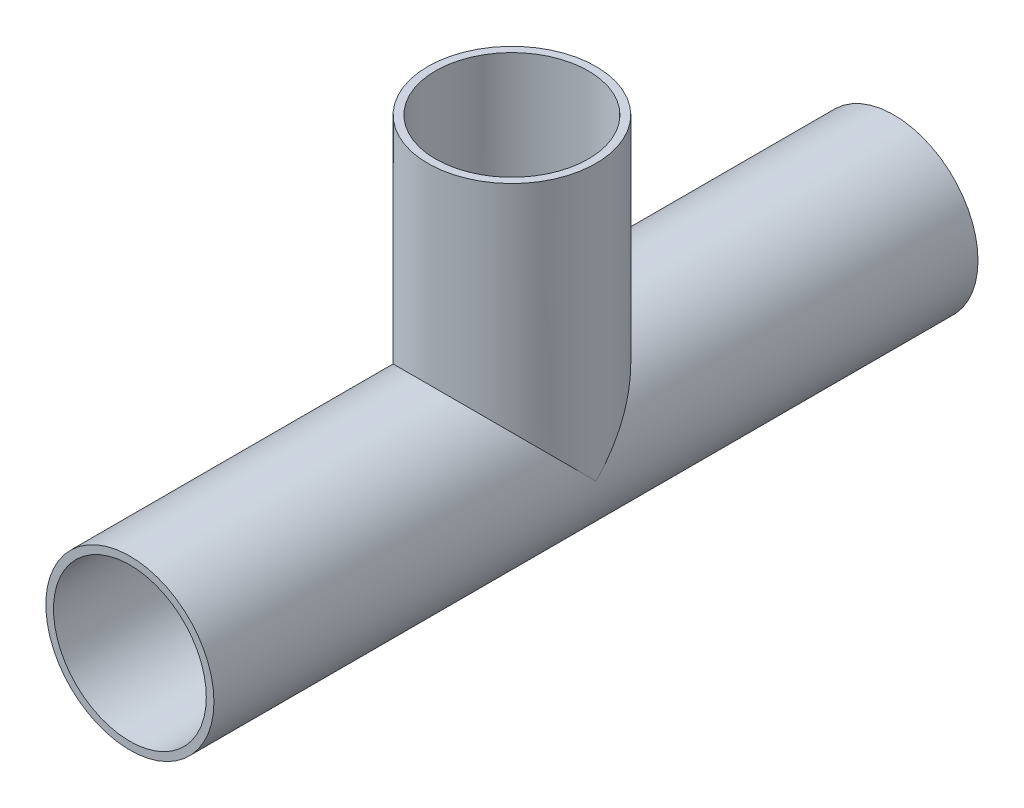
ISO-10303-21;
HEADER;
FILE_DESCRIPTION(('STEP AP214'),'2;1');
FILE_NAME('part.step','',(''),(''),'','','');
FILE_SCHEMA(('AUTOMOTIVE_DESIGN { 1 0 10303 214 1 1 1 1 }'));
ENDSEC;
DATA;
#1=APPLICATION_CONTEXT('core data for automotive mechanical design processes');
#2=APPLICATION_PROTOCOL_DEFINITION('international standard','automotive_design',2000,#1);
#3=PRODUCT_CONTEXT('',#1,'mechanical');
#4=PRODUCT('Part','Part','',(#3));
#5=PRODUCT_RELATED_PRODUCT_CATEGORY('part','',(#4));
#6=PRODUCT_DEFINITION_FORMATION('','',#4);
#7=PRODUCT_DEFINITION_CONTEXT('part definition',#1,'design');
#8=PRODUCT_DEFINITION('design','',#6,#7);
#9=PRODUCT_DEFINITION_SHAPE('','',#8);
#10=(LENGTH_UNIT() NAMED_UNIT(*) SI_UNIT(.MILLI.,.METRE.));
#11=(NAMED_UNIT(*) PLANE_ANGLE_UNIT() SI_UNIT($,.RADIAN.));
#12=(NAMED_UNIT(*) SI_UNIT($,.STERADIAN.) SOLID_ANGLE_UNIT());
#13=UNCERTAINTY_MEASURE_WITH_UNIT(LENGTH_MEASURE(1.E-05),#10,'distance_accuracy_value','');
#14=(GEOMETRIC_REPRESENTATION_CONTEXT(3) GLOBAL_UNCERTAINTY_ASSIGNED_CONTEXT((#13)) GLOBAL_UNIT_ASSIGNED_CONTEXT((#10,
#11,#12)) REPRESENTATION_CONTEXT('',''));
#15=CARTESIAN_POINT('',(0.,0.,0.));
#16=DIRECTION('',(0.,0.,1.));
#17=DIRECTION('',(1.,0.,0.));
#18=AXIS2_PLACEMENT_3D('',#15,#16,#17);
#19=CARTESIAN_POINT('',(0.,0.,250.));
#20=DIRECTION('',(0.,0.,1.));
#21=DIRECTION('',(1.,0.,0.));
#22=AXIS2_PLACEMENT_3D('',#19,#20,#21);
#23=PLANE('',#22);
#24=CARTESIAN_POINT('',(0.,0.,250.));
#25=DIRECTION('',(0.,0.,1.));
#26=DIRECTION('',(1.,0.,0.));
#27=AXIS2_PLACEMENT_3D('',#24,#25,#26);
#28=CIRCLE('',#27,55.);
#29=CARTESIAN_POINT('',(55.,0.,250.));
#30=VERTEX_POINT('',#29);
#31=EDGE_CURVE('E12',#30,#30,#28,.T.);
#32=ORIENTED_EDGE('',*,*,#31,.T.);
#33=EDGE_LOOP('',(#32));
#34=FACE_BOUND('',#33,.T.);
#35=CARTESIAN_POINT('',(0.,0.,250.));
#36=DIRECTION('',(0.,0.,1.));
#37=DIRECTION('',(1.,0.,0.));
#38=AXIS2_PLACEMENT_3D('',#35,#36,#37);
#39=CIRCLE('',#38,50.);
#40=CARTESIAN_POINT('',(50.,0.,250.));
#41=VERTEX_POINT('',#40);
#42=EDGE_CURVE('E89',#41,#41,#39,.T.);
#43=ORIENTED_EDGE('',*,*,#42,.F.);
#44=EDGE_LOOP('',(#43));
#45=FACE_BOUND('',#44,.T.);
#46=ADVANCED_FACE('F45',(#34,#45),#23,.T.);
#47=CARTESIAN_POINT('',(0.,0.,-250.));
#48=DIRECTION('',(0.,0.,1.));
#49=DIRECTION('',(1.,0.,0.));
#50=AXIS2_PLACEMENT_3D('',#47,#48,#49);
#51=PLANE('',#50);
#52=CARTESIAN_POINT('',(0.,0.,-250.));
#53=DIRECTION('',(0.,0.,1.));
#54=DIRECTION('',(1.,0.,0.));
#55=AXIS2_PLACEMENT_3D('',#52,#53,#54);
#56=CIRCLE('',#55,55.);
#57=CARTESIAN_POINT('',(55.,0.,-250.));
#58=VERTEX_POINT('',#57);
#59=EDGE_CURVE('E49',#58,#58,#56,.T.);
#60=ORIENTED_EDGE('',*,*,#59,.F.);
#61=EDGE_LOOP('',(#60));
#62=FACE_BOUND('',#61,.T.);
#63=CARTESIAN_POINT('',(0.,0.,-250.));
#64=DIRECTION('',(0.,0.,1.));
#65=DIRECTION('',(1.,0.,0.));
#66=AXIS2_PLACEMENT_3D('',#63,#64,#65);
#67=CIRCLE('',#66,50.);
#68=CARTESIAN_POINT('',(50.,0.,-250.));
#69=VERTEX_POINT('',#68);
#70=EDGE_CURVE('E85',#69,#69,#67,.T.);
#71=ORIENTED_EDGE('',*,*,#70,.T.);
#72=EDGE_LOOP('',(#71));
#73=FACE_BOUND('',#72,.T.);
#74=ADVANCED_FACE('F95',(#62,#73),#51,.F.);
#75=CARTESIAN_POINT('',(0.,0.,250.));
#76=DIRECTION('',(0.,0.,-1.));
#77=DIRECTION('',(-1.,0.,0.));
#78=AXIS2_PLACEMENT_3D('',#75,#76,#77);
#79=CYLINDRICAL_SURFACE('',#78,55.);
#80=CARTESIAN_POINT('',(0.,0.,0.));
#81=DIRECTION('',(0.,0.707106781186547,0.707106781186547));
#82=DIRECTION('',(0.,0.707106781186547,-0.707106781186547));
#83=AXIS2_PLACEMENT_3D('',#80,#81,#82);
#84=ELLIPSE('',#83,77.7817459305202,55.);
#85=CARTESIAN_POINT('',(55.,0.,0.));
#86=VERTEX_POINT('',#85);
#87=CARTESIAN_POINT('',(-55.,0.,0.));
#88=VERTEX_POINT('',#87);
#89=EDGE_CURVE('E83',#86,#88,#84,.T.);
#90=ORIENTED_EDGE('',*,*,#89,.F.);
#91=CARTESIAN_POINT('',(0.,0.,0.));
#92=DIRECTION('',(0.,0.707106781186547,-0.707106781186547));
#93=DIRECTION('',(0.,0.707106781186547,0.707106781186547));
#94=AXIS2_PLACEMENT_3D('',#91,#92,#93);
#95=ELLIPSE('',#94,77.7817459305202,55.);
#96=EDGE_CURVE('E66',#88,#86,#95,.T.);
#97=ORIENTED_EDGE('',*,*,#96,.F.);
#98=EDGE_LOOP('',(#90,#97));
#99=FACE_BOUND('',#98,.T.);
#100=ORIENTED_EDGE('',*,*,#31,.F.);
#101=EDGE_LOOP('',(#100));
#102=FACE_BOUND('',#101,.T.);
#103=ORIENTED_EDGE('',*,*,#59,.T.);
#104=EDGE_LOOP('',(#103));
#105=FACE_BOUND('',#104,.T.);
#106=ADVANCED_FACE('F47',(#99,#102,#105),#79,.T.);
#107=CARTESIAN_POINT('',(0.,0.,250.));
#108=DIRECTION('',(0.,0.,-1.));
#109=DIRECTION('',(-1.,0.,0.));
#110=AXIS2_PLACEMENT_3D('',#107,#108,#109);
#111=CYLINDRICAL_SURFACE('',#110,50.);
#112=CARTESIAN_POINT('',(0.,0.,0.));
#113=DIRECTION('',(0.,0.707106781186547,-0.707106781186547));
#114=DIRECTION('',(0.,0.707106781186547,0.707106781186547));
#115=AXIS2_PLACEMENT_3D('',#112,#113,#114);
#116=ELLIPSE('',#115,70.7106781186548,50.);
#117=CARTESIAN_POINT('',(-50.,0.,0.));
#118=VERTEX_POINT('',#117);
#119=CARTESIAN_POINT('',(50.,0.,0.));
#120=VERTEX_POINT('',#119);
#121=EDGE_CURVE('E59',#118,#120,#116,.T.);
#122=ORIENTED_EDGE('',*,*,#121,.T.);
#123=CARTESIAN_POINT('',(0.,0.,0.));
#124=DIRECTION('',(0.,0.707106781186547,0.707106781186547));
#125=DIRECTION('',(0.,0.707106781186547,-0.707106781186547));
#126=AXIS2_PLACEMENT_3D('',#123,#124,#125);
#127=ELLIPSE('',#126,70.7106781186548,50.);
#128=EDGE_CURVE('E71',#120,#118,#127,.T.);
#129=ORIENTED_EDGE('',*,*,#128,.T.);
#130=EDGE_LOOP('',(#122,#129));
#131=FACE_BOUND('',#130,.T.);
#132=ORIENTED_EDGE('',*,*,#42,.T.);
#133=EDGE_LOOP('',(#132));
#134=FACE_BOUND('',#133,.T.);
#135=ORIENTED_EDGE('',*,*,#70,.F.);
#136=EDGE_LOOP('',(#135));
#137=FACE_BOUND('',#136,.T.);
#138=ADVANCED_FACE('F75',(#131,#134,#137),#111,.F.);
#139=CARTESIAN_POINT('',(0.,-55.001,0.));
#140=DIRECTION('',(0.,1.,0.));
#141=DIRECTION('',(0.,0.,1.));
#142=AXIS2_PLACEMENT_3D('',#139,#140,#141);
#143=CYLINDRICAL_SURFACE('',#142,55.);
#144=CARTESIAN_POINT('',(0.,180.,0.));
#145=DIRECTION('',(0.,1.,0.));
#146=DIRECTION('',(-1.,0.,0.));
#147=AXIS2_PLACEMENT_3D('',#144,#145,#146);
#148=CIRCLE('',#147,55.);
#149=CARTESIAN_POINT('',(-55.,180.,0.));
#150=VERTEX_POINT('',#149);
#151=EDGE_CURVE('E80',#150,#150,#148,.T.);
#152=ORIENTED_EDGE('',*,*,#151,.F.);
#153=EDGE_LOOP('',(#152));
#154=FACE_BOUND('',#153,.T.);
#155=ORIENTED_EDGE('',*,*,#89,.T.);
#156=ORIENTED_EDGE('',*,*,#96,.T.);
#157=EDGE_LOOP('',(#155,#156));
#158=FACE_BOUND('',#157,.T.);
#159=ADVANCED_FACE('F98',(#154,#158),#143,.T.);
#160=CARTESIAN_POINT('',(0.,180.,0.));
#161=DIRECTION('',(0.,1.,0.));
#162=DIRECTION('',(0.,0.,1.));
#163=AXIS2_PLACEMENT_3D('',#160,#161,#162);
#164=PLANE('',#163);
#165=CARTESIAN_POINT('',(0.,180.,0.));
#166=DIRECTION('',(0.,1.,0.));
#167=DIRECTION('',(0.,0.,1.));
#168=AXIS2_PLACEMENT_3D('',#165,#166,#167);
#169=CIRCLE('',#168,50.);
#170=CARTESIAN_POINT('',(0.,180.,50.));
#171=VERTEX_POINT('',#170);
#172=EDGE_CURVE('E77',#171,#171,#169,.T.);
#173=ORIENTED_EDGE('',*,*,#172,.F.);
#174=EDGE_LOOP('',(#173));
#175=FACE_BOUND('',#174,.T.);
#176=ORIENTED_EDGE('',*,*,#151,.T.);
#177=EDGE_LOOP('',(#176));
#178=FACE_BOUND('',#177,.T.);
#179=ADVANCED_FACE('F104',(#175,#178),#164,.T.);
#180=CARTESIAN_POINT('',(0.,-55.001,0.));
#181=DIRECTION('',(0.,1.,0.));
#182=DIRECTION('',(0.,0.,1.));
#183=AXIS2_PLACEMENT_3D('',#180,#181,#182);
#184=CYLINDRICAL_SURFACE('',#183,50.);
#185=ORIENTED_EDGE('',*,*,#172,.T.);
#186=EDGE_LOOP('',(#185));
#187=FACE_BOUND('',#186,.T.);
#188=ORIENTED_EDGE('',*,*,#128,.F.);
#189=ORIENTED_EDGE('',*,*,#121,.F.);
#190=EDGE_LOOP('',(#188,#189));
#191=FACE_BOUND('',#190,.T.);
#192=ADVANCED_FACE('F72',(#187,#191),#184,.F.);
#193=CLOSED_SHELL('',(#46,#74,#106,#138,#159,#179,#192));
#194=MANIFOLD_SOLID_BREP('B2',#193);
#195=ADVANCED_BREP_SHAPE_REPRESENTATION('',(#18,#194),#14);
#196=SHAPE_DEFINITION_REPRESENTATION(#9,#195);
ENDSEC;
END-ISO-10303-21;
